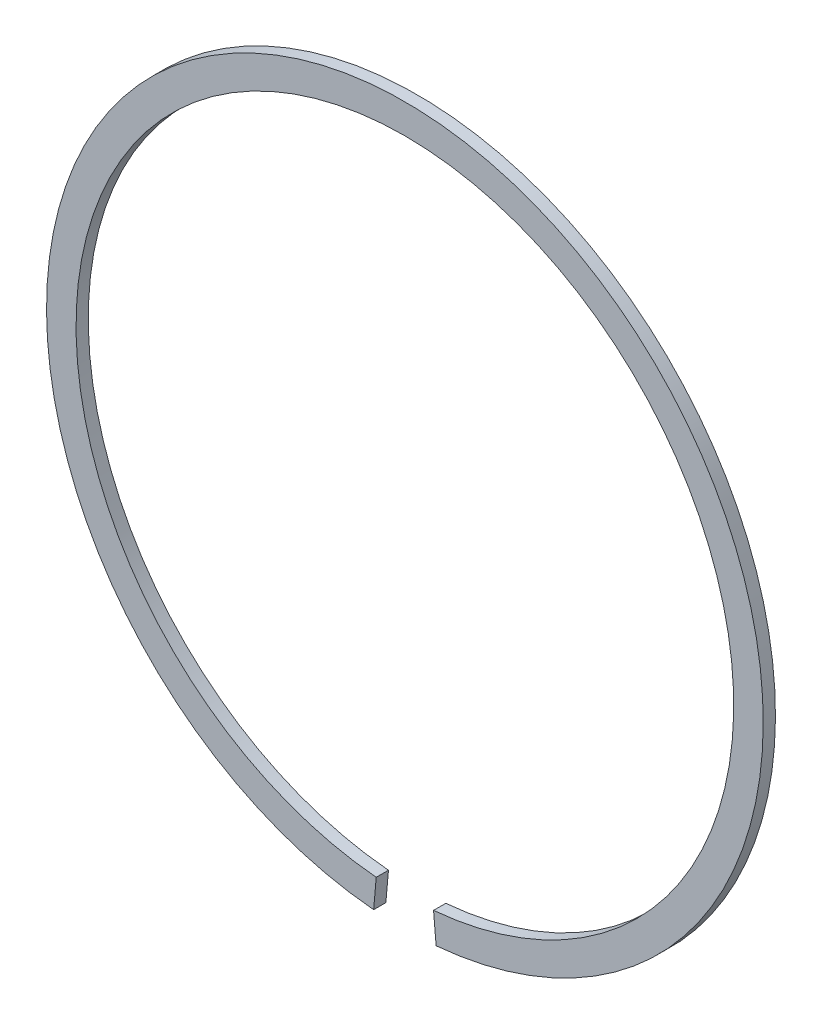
from build123d import *

# Parameters (mm, degrees)
BOSS_EXTRUDE1_DEPTH = 0.85


with BuildPart() as part:
    # Sketch1 → Boss-Extrude1 (new body)
    with BuildSketch(Plane.XY):
        with BuildLine():
            Line((-2.170177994, -24.805247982), (-1.991508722, -22.763048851))
            ThreePointArc((-1.991508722, -22.763048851), (0, 22.85), (1.991508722, -22.763048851))
            Line((1.991508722, -22.763048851), (2.170177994, -24.805247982))
            ThreePointArc((2.170177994, -24.805247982), (0, 24.9), (-2.170177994, -24.805247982))
        make_face()
    extrude(amount=BOSS_EXTRUDE1_DEPTH)


solid = part.part
